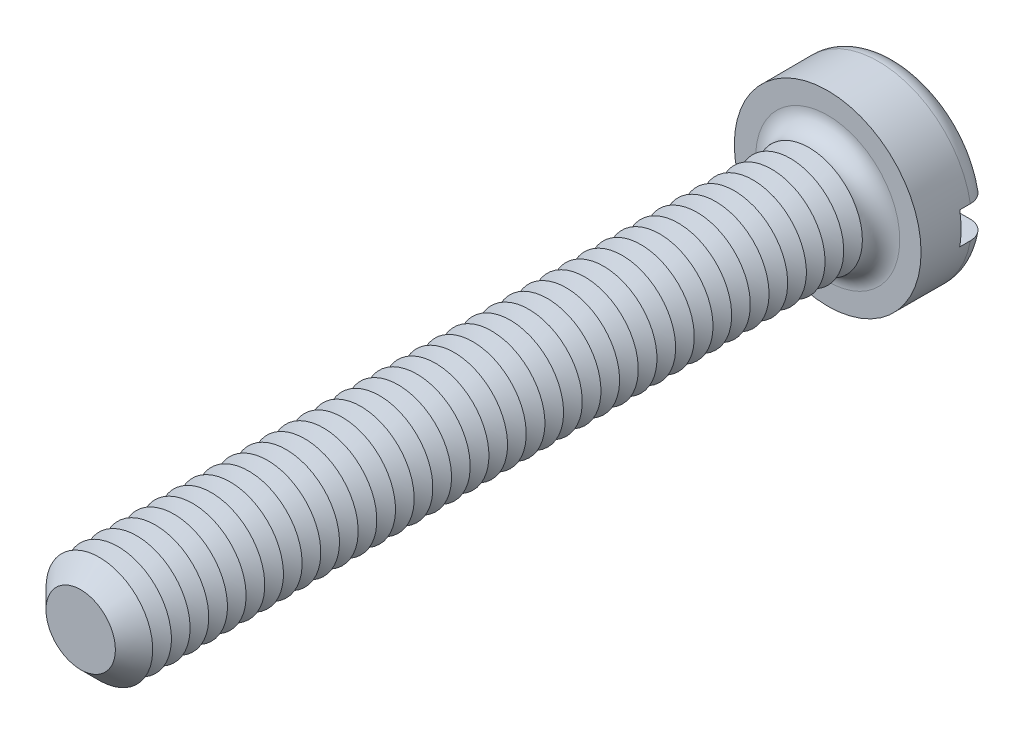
from build123d import *

# Parameters (mm, degrees)
SKETCH3_R           = 3.5
BOSS_EXTRUDE2_DEPTH = 2.6
SKETCH4_R           = 2
BOSS_EXTRUDE3_DEPTH = 28
FILLET1_R           = 0.7
CHAMFER1_SIZE       = 0.7
LPATTERN1_COUNT     = 38
LPATTERN1_PITCH     = 0.7
SKETCH8_W           = 7
SKETCH8_H           = 1.2
CUT_EXTRUDE1_DEPTH  = 1.1


with BuildPart() as part:
    # Sketch3 → Boss-Extrude2 (new body)
    with BuildSketch(Plane.XY):
        Circle(SKETCH3_R)
    extrude(amount=-BOSS_EXTRUDE2_DEPTH)

    # Sketch4 → Boss-Extrude3 (add)
    with BuildSketch(Plane.XY):
        Circle(SKETCH4_R)
    extrude(amount=BOSS_EXTRUDE3_DEPTH)

    # Fillet1
    fillet1_edges = [part.edges().sort_by_distance(p)[0] for p in [
        (-3.5, 0, -2.6),
        (-2, 0, 0),
    ]]
    fillet(fillet1_edges, radius=FILLET1_R)

    # Chamfer1
    chamfer1_edges = [part.edges().sort_by_distance(p)[0] for p in [
        (-2, 0, 28),
    ]]
    chamfer(chamfer1_edges, length=CHAMFER1_SIZE)

    # Sketch6 → Cut-Revolve1 (revolve, cut)
    with BuildSketch(Plane(origin=(0, 0, 0), x_dir=(0, 0, -1), z_dir=(1, 0, 0)), mode=Mode.PRIVATE) as cut_revolve1_sk:
        Polygon((-0.7, 2), (-1.05, 1.393782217), (-1.4, 2), align=None)
    cut_revolve1 = revolve(cut_revolve1_sk.sketch.rotate(Axis((0, 0, -1.694361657), (0, 0, 1)), 90), axis=Axis((0, 0, -1.694361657), (0, 0, 1)), mode=Mode.SUBTRACT)

    # LPattern1: Cut-Revolve1 ×38
    with Locations(*[(0, 0, i * LPATTERN1_PITCH) for i in range(1, LPATTERN1_COUNT)]):
        add(cut_revolve1, mode=Mode.SUBTRACT)

    # Sketch8 → Cut-Extrude1 (cut)
    with BuildSketch(Plane(origin=(0, 0, -2.6), x_dir=(-1, 0, 0), z_dir=(0, 0, -1))):
        Rectangle(SKETCH8_W, SKETCH8_H)
    extrude(amount=-CUT_EXTRUDE1_DEPTH, mode=Mode.SUBTRACT)


solid = part.part
